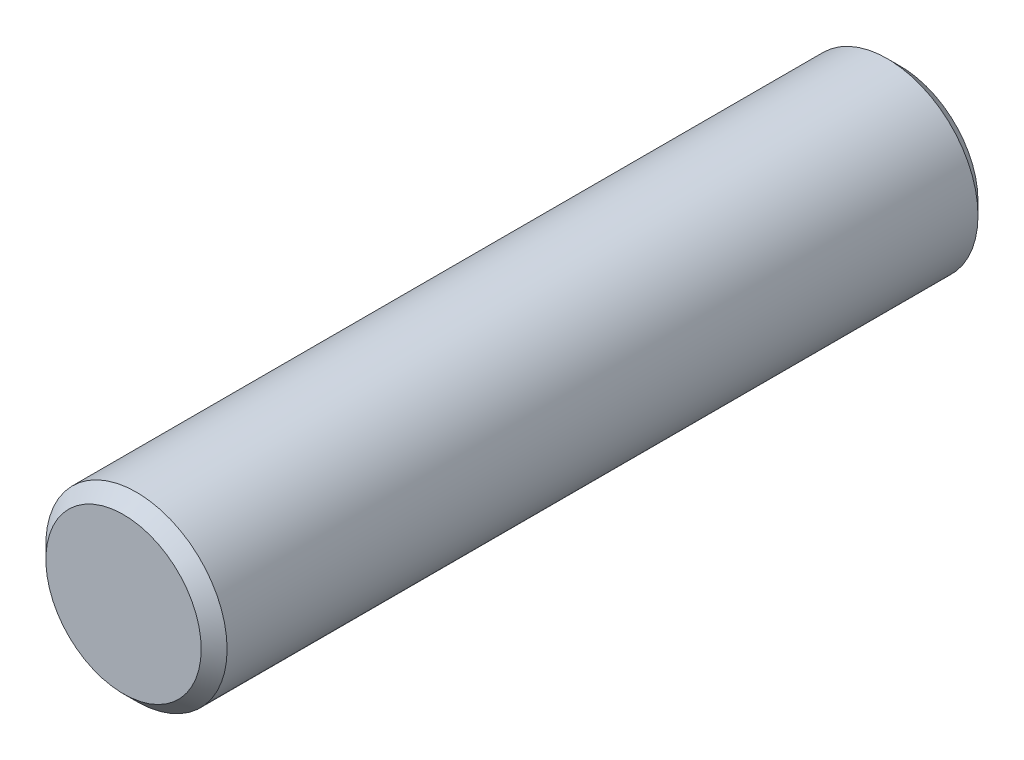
ISO-10303-21;
HEADER;
FILE_DESCRIPTION(('STEP AP214'),'2;1');
FILE_NAME('part.step','',(''),(''),'','','');
FILE_SCHEMA(('AUTOMOTIVE_DESIGN { 1 0 10303 214 1 1 1 1 }'));
ENDSEC;
DATA;
#1=APPLICATION_CONTEXT('core data for automotive mechanical design processes');
#2=APPLICATION_PROTOCOL_DEFINITION('international standard','automotive_design',2000,#1);
#3=PRODUCT_CONTEXT('',#1,'mechanical');
#4=PRODUCT('Part','Part','',(#3));
#5=PRODUCT_RELATED_PRODUCT_CATEGORY('part','',(#4));
#6=PRODUCT_DEFINITION_FORMATION('','',#4);
#7=PRODUCT_DEFINITION_CONTEXT('part definition',#1,'design');
#8=PRODUCT_DEFINITION('design','',#6,#7);
#9=PRODUCT_DEFINITION_SHAPE('','',#8);
#10=(LENGTH_UNIT() NAMED_UNIT(*) SI_UNIT(.MILLI.,.METRE.));
#11=(NAMED_UNIT(*) PLANE_ANGLE_UNIT() SI_UNIT($,.RADIAN.));
#12=(NAMED_UNIT(*) SI_UNIT($,.STERADIAN.) SOLID_ANGLE_UNIT());
#13=UNCERTAINTY_MEASURE_WITH_UNIT(LENGTH_MEASURE(1.E-05),#10,'distance_accuracy_value','');
#14=(GEOMETRIC_REPRESENTATION_CONTEXT(3) GLOBAL_UNCERTAINTY_ASSIGNED_CONTEXT((#13)) GLOBAL_UNIT_ASSIGNED_CONTEXT((#10,
#11,#12)) REPRESENTATION_CONTEXT('',''));
#15=CARTESIAN_POINT('',(0.,0.,0.));
#16=DIRECTION('',(0.,0.,1.));
#17=DIRECTION('',(1.,0.,0.));
#18=AXIS2_PLACEMENT_3D('',#15,#16,#17);
#19=CARTESIAN_POINT('',(0.,0.,30.));
#20=DIRECTION('',(0.,0.,-1.));
#21=DIRECTION('',(-1.,0.,0.));
#22=AXIS2_PLACEMENT_3D('',#19,#20,#21);
#23=CYLINDRICAL_SURFACE('',#22,3.5);
#24=CARTESIAN_POINT('',(0.,0.,0.500000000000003));
#25=DIRECTION('',(0.,0.,1.));
#26=DIRECTION('',(1.,0.,0.));
#27=AXIS2_PLACEMENT_3D('',#24,#25,#26);
#28=CIRCLE('',#27,3.5);
#29=CARTESIAN_POINT('',(3.5,0.,0.500000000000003));
#30=VERTEX_POINT('',#29);
#31=EDGE_CURVE('E39',#30,#30,#28,.T.);
#32=ORIENTED_EDGE('',*,*,#31,.T.);
#33=EDGE_LOOP('',(#32));
#34=FACE_BOUND('',#33,.T.);
#35=CARTESIAN_POINT('',(0.,0.,29.5));
#36=DIRECTION('',(0.,0.,1.));
#37=DIRECTION('',(1.,0.,0.));
#38=AXIS2_PLACEMENT_3D('',#35,#36,#37);
#39=CIRCLE('',#38,3.5);
#40=CARTESIAN_POINT('',(3.5,0.,29.5));
#41=VERTEX_POINT('',#40);
#42=EDGE_CURVE('E43',#41,#41,#39,.F.);
#43=ORIENTED_EDGE('',*,*,#42,.T.);
#44=EDGE_LOOP('',(#43));
#45=FACE_BOUND('',#44,.T.);
#46=ADVANCED_FACE('F29',(#34,#45),#23,.T.);
#47=CARTESIAN_POINT('',(0.,0.,30.));
#48=DIRECTION('',(0.,0.,1.));
#49=DIRECTION('',(1.,0.,0.));
#50=AXIS2_PLACEMENT_3D('',#47,#48,#49);
#51=PLANE('',#50);
#52=CARTESIAN_POINT('',(0.,0.,30.));
#53=DIRECTION('',(0.,0.,1.));
#54=DIRECTION('',(1.,0.,0.));
#55=AXIS2_PLACEMENT_3D('',#52,#53,#54);
#56=CIRCLE('',#55,2.99999999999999);
#57=CARTESIAN_POINT('',(2.99999999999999,0.,30.));
#58=VERTEX_POINT('',#57);
#59=EDGE_CURVE('E10',#58,#58,#56,.T.);
#60=ORIENTED_EDGE('',*,*,#59,.T.);
#61=EDGE_LOOP('',(#60));
#62=FACE_BOUND('',#61,.T.);
#63=ADVANCED_FACE('F62',(#62),#51,.T.);
#64=CARTESIAN_POINT('',(0.,0.,0.));
#65=DIRECTION('',(0.,0.,1.));
#66=DIRECTION('',(1.,0.,0.));
#67=AXIS2_PLACEMENT_3D('',#64,#65,#66);
#68=PLANE('',#67);
#69=CARTESIAN_POINT('',(0.,0.,0.));
#70=DIRECTION('',(0.,0.,1.));
#71=DIRECTION('',(1.,0.,0.));
#72=AXIS2_PLACEMENT_3D('',#69,#70,#71);
#73=CIRCLE('',#72,2.99999999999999);
#74=CARTESIAN_POINT('',(2.99999999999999,0.,0.));
#75=VERTEX_POINT('',#74);
#76=EDGE_CURVE('E35',#75,#75,#73,.F.);
#77=ORIENTED_EDGE('',*,*,#76,.T.);
#78=EDGE_LOOP('',(#77));
#79=FACE_BOUND('',#78,.T.);
#80=ADVANCED_FACE('F58',(#79),#68,.F.);
#81=CARTESIAN_POINT('',(0.,0.,0.500000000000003));
#82=DIRECTION('',(0.,0.,1.));
#83=DIRECTION('',(1.,0.,0.));
#84=AXIS2_PLACEMENT_3D('',#81,#82,#83);
#85=CONICAL_SURFACE('',#84,3.5,0.785398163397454);
#86=ORIENTED_EDGE('',*,*,#76,.F.);
#87=EDGE_LOOP('',(#86));
#88=FACE_BOUND('',#87,.T.);
#89=ORIENTED_EDGE('',*,*,#31,.F.);
#90=EDGE_LOOP('',(#89));
#91=FACE_BOUND('',#90,.T.);
#92=ADVANCED_FACE('F53',(#88,#91),#85,.T.);
#93=CARTESIAN_POINT('',(0.,0.,30.));
#94=DIRECTION('',(0.,0.,-1.));
#95=DIRECTION('',(-1.,0.,0.));
#96=AXIS2_PLACEMENT_3D('',#93,#94,#95);
#97=CONICAL_SURFACE('',#96,2.99999999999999,0.785398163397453);
#98=ORIENTED_EDGE('',*,*,#42,.F.);
#99=EDGE_LOOP('',(#98));
#100=FACE_BOUND('',#99,.T.);
#101=ORIENTED_EDGE('',*,*,#59,.F.);
#102=EDGE_LOOP('',(#101));
#103=FACE_BOUND('',#102,.T.);
#104=ADVANCED_FACE('F50',(#100,#103),#97,.T.);
#105=CLOSED_SHELL('',(#46,#63,#80,#92,#104));
#106=MANIFOLD_SOLID_BREP('B2',#105);
#107=ADVANCED_BREP_SHAPE_REPRESENTATION('',(#18,#106),#14);
#108=SHAPE_DEFINITION_REPRESENTATION(#9,#107);
ENDSEC;
END-ISO-10303-21;
